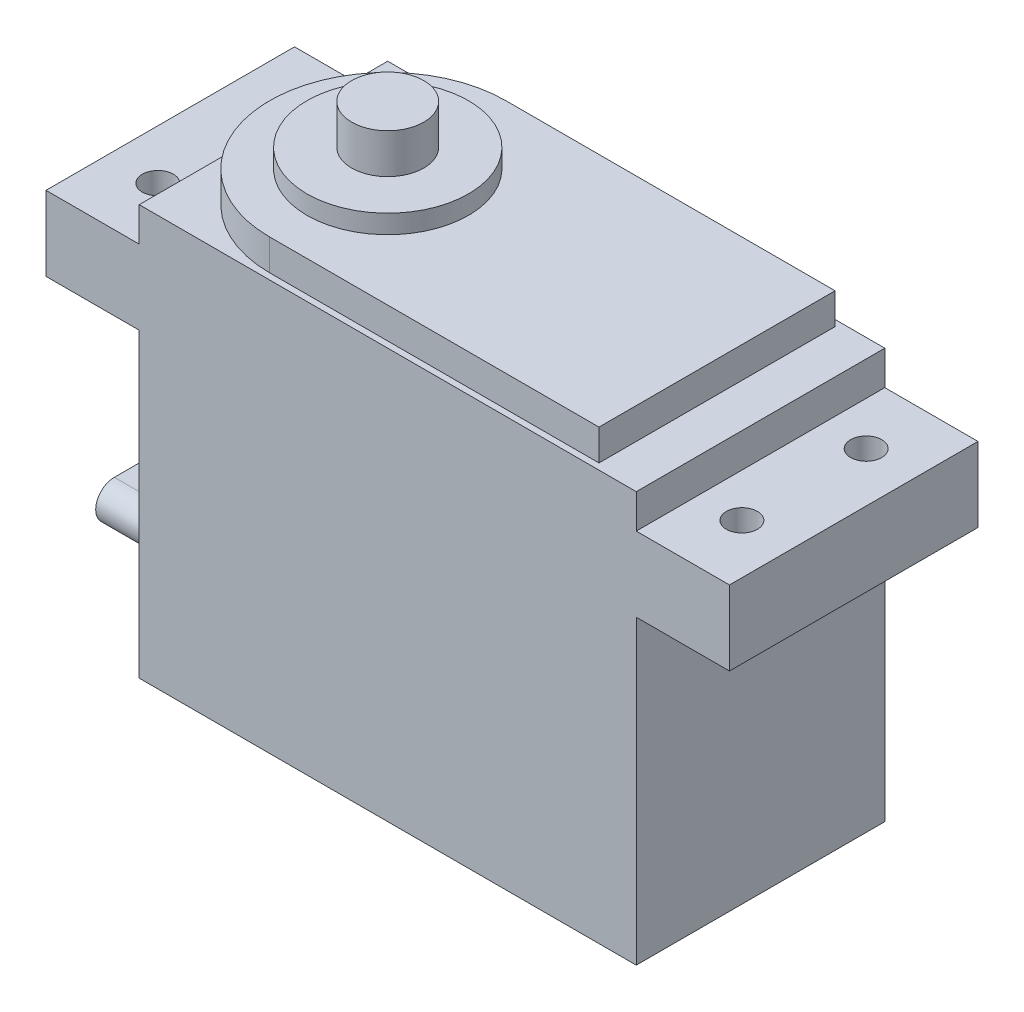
ISO-10303-21;
HEADER;
FILE_DESCRIPTION(('STEP AP214'),'2;1');
FILE_NAME('part.step','',(''),(''),'','','');
FILE_SCHEMA(('AUTOMOTIVE_DESIGN { 1 0 10303 214 1 1 1 1 }'));
ENDSEC;
DATA;
#1=APPLICATION_CONTEXT('core data for automotive mechanical design processes');
#2=APPLICATION_PROTOCOL_DEFINITION('international standard','automotive_design',2000,#1);
#3=PRODUCT_CONTEXT('',#1,'mechanical');
#4=PRODUCT('Part','Part','',(#3));
#5=PRODUCT_RELATED_PRODUCT_CATEGORY('part','',(#4));
#6=PRODUCT_DEFINITION_FORMATION('','',#4);
#7=PRODUCT_DEFINITION_CONTEXT('part definition',#1,'design');
#8=PRODUCT_DEFINITION('design','',#6,#7);
#9=PRODUCT_DEFINITION_SHAPE('','',#8);
#10=(LENGTH_UNIT() NAMED_UNIT(*) SI_UNIT(.MILLI.,.METRE.));
#11=(NAMED_UNIT(*) PLANE_ANGLE_UNIT() SI_UNIT($,.RADIAN.));
#12=(NAMED_UNIT(*) SI_UNIT($,.STERADIAN.) SOLID_ANGLE_UNIT());
#13=UNCERTAINTY_MEASURE_WITH_UNIT(LENGTH_MEASURE(1.E-05),#10,'distance_accuracy_value','');
#14=(GEOMETRIC_REPRESENTATION_CONTEXT(3) GLOBAL_UNCERTAINTY_ASSIGNED_CONTEXT((#13)) GLOBAL_UNIT_ASSIGNED_CONTEXT((#10,
#11,#12)) REPRESENTATION_CONTEXT('',''));
#15=CARTESIAN_POINT('',(0.,0.,0.));
#16=DIRECTION('',(0.,0.,1.));
#17=DIRECTION('',(1.,0.,0.));
#18=AXIS2_PLACEMENT_3D('',#15,#16,#17);
#19=CARTESIAN_POINT('',(-0.5,3.,9.5));
#20=DIRECTION('',(-1.,0.,0.));
#21=DIRECTION('',(0.,0.,1.));
#22=AXIS2_PLACEMENT_3D('',#19,#20,#21);
#23=PLANE('',#22);
#24=CARTESIAN_POINT('',(-0.5,3.,9.5));
#25=DIRECTION('',(-1.,0.,0.));
#26=DIRECTION('',(0.,0.,1.));
#27=AXIS2_PLACEMENT_3D('',#24,#25,#26);
#28=CIRCLE('',#27,2.);
#29=CARTESIAN_POINT('',(-0.5,5.,9.5));
#30=VERTEX_POINT('',#29);
#31=CARTESIAN_POINT('',(-0.5,1.,9.50000000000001));
#32=VERTEX_POINT('',#31);
#33=EDGE_CURVE('E230',#30,#32,#28,.T.);
#34=ORIENTED_EDGE('',*,*,#33,.T.);
#35=DIRECTION('',(0.,0.,1.));
#36=VECTOR('',#35,1.);
#37=CARTESIAN_POINT('',(-0.5,1.,11.5));
#38=LINE('',#37,#36);
#39=CARTESIAN_POINT('',(-0.5,1.,11.5));
#40=VERTEX_POINT('',#39);
#41=EDGE_CURVE('E233',#32,#40,#38,.T.);
#42=ORIENTED_EDGE('',*,*,#41,.T.);
#43=CARTESIAN_POINT('',(-0.5,3.,11.5));
#44=DIRECTION('',(-1.,0.,0.));
#45=DIRECTION('',(0.,0.,-1.));
#46=AXIS2_PLACEMENT_3D('',#43,#44,#45);
#47=CIRCLE('',#46,2.);
#48=CARTESIAN_POINT('',(-0.5,5.,11.5));
#49=VERTEX_POINT('',#48);
#50=EDGE_CURVE('E236',#40,#49,#47,.T.);
#51=ORIENTED_EDGE('',*,*,#50,.T.);
#52=DIRECTION('',(0.,0.,-1.));
#53=VECTOR('',#52,1.);
#54=CARTESIAN_POINT('',(-0.5,5.,9.5));
#55=LINE('',#54,#53);
#56=EDGE_CURVE('E238',#49,#30,#55,.T.);
#57=ORIENTED_EDGE('',*,*,#56,.T.);
#58=EDGE_LOOP('',(#34,#42,#51,#57));
#59=FACE_BOUND('',#58,.T.);
#60=DIRECTION('',(0.,0.,1.));
#61=VECTOR('',#60,1.);
#62=CARTESIAN_POINT('',(-0.5,1.5,9.50000000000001));
#63=LINE('',#62,#61);
#64=CARTESIAN_POINT('',(-0.5,1.5,9.50000000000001));
#65=VERTEX_POINT('',#64);
#66=CARTESIAN_POINT('',(-0.5,1.5,11.5));
#67=VERTEX_POINT('',#66);
#68=EDGE_CURVE('E799',#65,#67,#63,.T.);
#69=ORIENTED_EDGE('',*,*,#68,.F.);
#70=CARTESIAN_POINT('',(-0.5,3.,9.5));
#71=DIRECTION('',(-1.,0.,0.));
#72=DIRECTION('',(0.,0.,1.));
#73=AXIS2_PLACEMENT_3D('',#70,#71,#72);
#74=CIRCLE('',#73,1.5);
#75=CARTESIAN_POINT('',(-0.5,4.5,9.5));
#76=VERTEX_POINT('',#75);
#77=EDGE_CURVE('E221',#76,#65,#74,.T.);
#78=ORIENTED_EDGE('',*,*,#77,.F.);
#79=DIRECTION('',(0.,0.,-1.));
#80=VECTOR('',#79,1.);
#81=CARTESIAN_POINT('',(-0.5,4.5,11.5));
#82=LINE('',#81,#80);
#83=CARTESIAN_POINT('',(-0.5,4.5,11.5));
#84=VERTEX_POINT('',#83);
#85=EDGE_CURVE('E217',#84,#76,#82,.T.);
#86=ORIENTED_EDGE('',*,*,#85,.F.);
#87=CARTESIAN_POINT('',(-0.5,3.,11.5));
#88=DIRECTION('',(-1.,0.,0.));
#89=DIRECTION('',(0.,0.,1.));
#90=AXIS2_PLACEMENT_3D('',#87,#88,#89);
#91=CIRCLE('',#90,1.5);
#92=EDGE_CURVE('E796',#67,#84,#91,.T.);
#93=ORIENTED_EDGE('',*,*,#92,.F.);
#94=EDGE_LOOP('',(#69,#78,#86,#93));
#95=FACE_BOUND('',#94,.T.);
#96=ADVANCED_FACE('F35',(#59,#95),#23,.T.);
#97=CARTESIAN_POINT('',(0.,0.,20.));
#98=DIRECTION('',(1.,0.,0.));
#99=DIRECTION('',(0.,0.,-1.));
#100=AXIS2_PLACEMENT_3D('',#97,#98,#99);
#101=PLANE('',#100);
#102=DIRECTION('',(0.,-1.,0.));
#103=VECTOR('',#102,1.);
#104=CARTESIAN_POINT('',(0.,0.,0.));
#105=LINE('',#104,#103);
#106=CARTESIAN_POINT('',(0.,24.25,0.));
#107=VERTEX_POINT('',#106);
#108=CARTESIAN_POINT('',(0.,0.,0.));
#109=VERTEX_POINT('',#108);
#110=EDGE_CURVE('E348',#107,#109,#105,.T.);
#111=ORIENTED_EDGE('',*,*,#110,.T.);
#112=DIRECTION('',(0.,0.,-1.));
#113=VECTOR('',#112,1.);
#114=CARTESIAN_POINT('',(0.,0.,20.));
#115=LINE('',#114,#113);
#116=CARTESIAN_POINT('',(0.,0.,20.));
#117=VERTEX_POINT('',#116);
#118=EDGE_CURVE('E11',#117,#109,#115,.T.);
#119=ORIENTED_EDGE('',*,*,#118,.F.);
#120=DIRECTION('',(0.,-1.,0.));
#121=VECTOR('',#120,1.);
#122=CARTESIAN_POINT('',(0.,0.,20.));
#123=LINE('',#122,#121);
#124=CARTESIAN_POINT('',(0.,24.25,20.));
#125=VERTEX_POINT('',#124);
#126=EDGE_CURVE('E321',#125,#117,#123,.T.);
#127=ORIENTED_EDGE('',*,*,#126,.F.);
#128=DIRECTION('',(0.,0.,-1.));
#129=VECTOR('',#128,1.);
#130=CARTESIAN_POINT('',(0.,24.25,20.));
#131=LINE('',#130,#129);
#132=EDGE_CURVE('E347',#125,#107,#131,.T.);
#133=ORIENTED_EDGE('',*,*,#132,.T.);
#134=EDGE_LOOP('',(#111,#119,#127,#133));
#135=FACE_BOUND('',#134,.T.);
#136=CARTESIAN_POINT('',(0.,3.,9.5));
#137=DIRECTION('',(-1.,0.,0.));
#138=DIRECTION('',(0.,0.,1.));
#139=AXIS2_PLACEMENT_3D('',#136,#137,#138);
#140=CIRCLE('',#139,2.);
#141=CARTESIAN_POINT('',(0.,5.,9.5));
#142=VERTEX_POINT('',#141);
#143=CARTESIAN_POINT('',(0.,1.,9.50000000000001));
#144=VERTEX_POINT('',#143);
#145=EDGE_CURVE('E223',#142,#144,#140,.T.);
#146=ORIENTED_EDGE('',*,*,#145,.F.);
#147=DIRECTION('',(0.,0.,-1.));
#148=VECTOR('',#147,1.);
#149=CARTESIAN_POINT('',(0.,5.,9.5));
#150=LINE('',#149,#148);
#151=CARTESIAN_POINT('',(0.,5.,11.5));
#152=VERTEX_POINT('',#151);
#153=EDGE_CURVE('E234',#152,#142,#150,.T.);
#154=ORIENTED_EDGE('',*,*,#153,.F.);
#155=CARTESIAN_POINT('',(0.,3.,11.5));
#156=DIRECTION('',(-1.,0.,0.));
#157=DIRECTION('',(0.,0.,-1.));
#158=AXIS2_PLACEMENT_3D('',#155,#156,#157);
#159=CIRCLE('',#158,2.);
#160=CARTESIAN_POINT('',(0.,1.,11.5));
#161=VERTEX_POINT('',#160);
#162=EDGE_CURVE('E242',#161,#152,#159,.T.);
#163=ORIENTED_EDGE('',*,*,#162,.F.);
#164=DIRECTION('',(0.,0.,1.));
#165=VECTOR('',#164,1.);
#166=CARTESIAN_POINT('',(0.,1.,11.5));
#167=LINE('',#166,#165);
#168=EDGE_CURVE('E60',#144,#161,#167,.T.);
#169=ORIENTED_EDGE('',*,*,#168,.F.);
#170=EDGE_LOOP('',(#146,#154,#163,#169));
#171=FACE_BOUND('',#170,.T.);
#172=ADVANCED_FACE('F37',(#135,#171),#101,.F.);
#173=CARTESIAN_POINT('',(10.,37.,10.));
#174=DIRECTION('',(0.,1.,0.));
#175=DIRECTION('',(0.,0.,1.));
#176=AXIS2_PLACEMENT_3D('',#173,#174,#175);
#177=PLANE('',#176);
#178=CARTESIAN_POINT('',(10.,37.,10.));
#179=DIRECTION('',(0.,1.,0.));
#180=DIRECTION('',(0.,0.,1.));
#181=AXIS2_PLACEMENT_3D('',#178,#179,#180);
#182=CIRCLE('',#181,6.5);
#183=CARTESIAN_POINT('',(10.,37.,16.5));
#184=VERTEX_POINT('',#183);
#185=EDGE_CURVE('E264',#184,#184,#182,.T.);
#186=ORIENTED_EDGE('',*,*,#185,.T.);
#187=EDGE_LOOP('',(#186));
#188=FACE_BOUND('',#187,.T.);
#189=CARTESIAN_POINT('',(10.,37.,10.));
#190=DIRECTION('',(0.,1.,0.));
#191=DIRECTION('',(0.,0.,1.));
#192=AXIS2_PLACEMENT_3D('',#189,#190,#191);
#193=CIRCLE('',#192,2.9);
#194=CARTESIAN_POINT('',(10.,37.,12.9));
#195=VERTEX_POINT('',#194);
#196=EDGE_CURVE('E257',#195,#195,#193,.T.);
#197=ORIENTED_EDGE('',*,*,#196,.F.);
#198=EDGE_LOOP('',(#197));
#199=FACE_BOUND('',#198,.T.);
#200=ADVANCED_FACE('F431',(#188,#199),#177,.T.);
#201=CARTESIAN_POINT('',(10.,35.5,10.));
#202=DIRECTION('',(0.,1.,0.));
#203=DIRECTION('',(0.,0.,1.));
#204=AXIS2_PLACEMENT_3D('',#201,#202,#203);
#205=PLANE('',#204);
#206=DIRECTION('',(0.,0.,-1.));
#207=VECTOR('',#206,1.);
#208=CARTESIAN_POINT('',(36.5,35.5,0.5));
#209=LINE('',#208,#207);
#210=CARTESIAN_POINT('',(36.5,35.5,19.5));
#211=VERTEX_POINT('',#210);
#212=CARTESIAN_POINT('',(36.5,35.5,0.5));
#213=VERTEX_POINT('',#212);
#214=EDGE_CURVE('E270',#211,#213,#209,.T.);
#215=ORIENTED_EDGE('',*,*,#214,.T.);
#216=DIRECTION('',(-1.,0.,0.));
#217=VECTOR('',#216,1.);
#218=CARTESIAN_POINT('',(10.,35.5,0.5));
#219=LINE('',#218,#217);
#220=CARTESIAN_POINT('',(10.,35.5,0.5));
#221=VERTEX_POINT('',#220);
#222=EDGE_CURVE('E273',#213,#221,#219,.T.);
#223=ORIENTED_EDGE('',*,*,#222,.T.);
#224=CARTESIAN_POINT('',(10.,35.5,10.));
#225=DIRECTION('',(0.,1.,0.));
#226=DIRECTION('',(0.,0.,1.));
#227=AXIS2_PLACEMENT_3D('',#224,#225,#226);
#228=CIRCLE('',#227,9.5);
#229=CARTESIAN_POINT('',(10.,35.5,19.5));
#230=VERTEX_POINT('',#229);
#231=EDGE_CURVE('E276',#221,#230,#228,.T.);
#232=ORIENTED_EDGE('',*,*,#231,.T.);
#233=DIRECTION('',(1.,0.,0.));
#234=VECTOR('',#233,1.);
#235=CARTESIAN_POINT('',(36.5,35.5,19.5));
#236=LINE('',#235,#234);
#237=EDGE_CURVE('E278',#230,#211,#236,.T.);
#238=ORIENTED_EDGE('',*,*,#237,.T.);
#239=EDGE_LOOP('',(#215,#223,#232,#238));
#240=FACE_BOUND('',#239,.T.);
#241=CARTESIAN_POINT('',(10.,35.5,10.));
#242=DIRECTION('',(0.,1.,0.));
#243=DIRECTION('',(0.,0.,1.));
#244=AXIS2_PLACEMENT_3D('',#241,#242,#243);
#245=CIRCLE('',#244,6.5);
#246=CARTESIAN_POINT('',(10.,35.5,16.5));
#247=VERTEX_POINT('',#246);
#248=EDGE_CURVE('E261',#247,#247,#245,.T.);
#249=ORIENTED_EDGE('',*,*,#248,.F.);
#250=EDGE_LOOP('',(#249));
#251=FACE_BOUND('',#250,.T.);
#252=ADVANCED_FACE('F464',(#240,#251),#205,.T.);
#253=CARTESIAN_POINT('',(0.,33.,20.));
#254=DIRECTION('',(0.,-1.,0.));
#255=DIRECTION('',(0.,0.,-1.));
#256=AXIS2_PLACEMENT_3D('',#253,#254,#255);
#257=PLANE('',#256);
#258=DIRECTION('',(-1.,0.,0.));
#259=VECTOR('',#258,1.);
#260=CARTESIAN_POINT('',(0.,33.,0.));
#261=LINE('',#260,#259);
#262=CARTESIAN_POINT('',(40.,33.,0.));
#263=VERTEX_POINT('',#262);
#264=CARTESIAN_POINT('',(0.,33.,0.));
#265=VERTEX_POINT('',#264);
#266=EDGE_CURVE('E363',#263,#265,#261,.T.);
#267=ORIENTED_EDGE('',*,*,#266,.T.);
#268=DIRECTION('',(0.,0.,-1.));
#269=VECTOR('',#268,1.);
#270=CARTESIAN_POINT('',(0.,33.,20.));
#271=LINE('',#270,#269);
#272=CARTESIAN_POINT('',(0.,33.,20.));
#273=VERTEX_POINT('',#272);
#274=EDGE_CURVE('E383',#273,#265,#271,.T.);
#275=ORIENTED_EDGE('',*,*,#274,.F.);
#276=DIRECTION('',(-1.,0.,0.));
#277=VECTOR('',#276,1.);
#278=CARTESIAN_POINT('',(0.,33.,20.));
#279=LINE('',#278,#277);
#280=CARTESIAN_POINT('',(40.,33.,20.));
#281=VERTEX_POINT('',#280);
#282=EDGE_CURVE('E337',#281,#273,#279,.T.);
#283=ORIENTED_EDGE('',*,*,#282,.F.);
#284=DIRECTION('',(0.,0.,-1.));
#285=VECTOR('',#284,1.);
#286=CARTESIAN_POINT('',(40.,33.,20.));
#287=LINE('',#286,#285);
#288=EDGE_CURVE('E386',#281,#263,#287,.T.);
#289=ORIENTED_EDGE('',*,*,#288,.T.);
#290=EDGE_LOOP('',(#267,#275,#283,#289));
#291=FACE_BOUND('',#290,.T.);
#292=DIRECTION('',(0.,0.,-1.));
#293=VECTOR('',#292,1.);
#294=CARTESIAN_POINT('',(36.5,33.,0.5));
#295=LINE('',#294,#293);
#296=CARTESIAN_POINT('',(36.5,33.,19.5));
#297=VERTEX_POINT('',#296);
#298=CARTESIAN_POINT('',(36.5,33.,0.5));
#299=VERTEX_POINT('',#298);
#300=EDGE_CURVE('E267',#297,#299,#295,.T.);
#301=ORIENTED_EDGE('',*,*,#300,.F.);
#302=DIRECTION('',(1.,0.,0.));
#303=VECTOR('',#302,1.);
#304=CARTESIAN_POINT('',(36.5,33.,19.5));
#305=LINE('',#304,#303);
#306=CARTESIAN_POINT('',(10.,33.,19.5));
#307=VERTEX_POINT('',#306);
#308=EDGE_CURVE('E274',#307,#297,#305,.T.);
#309=ORIENTED_EDGE('',*,*,#308,.F.);
#310=CARTESIAN_POINT('',(10.,33.,10.));
#311=DIRECTION('',(0.,1.,0.));
#312=DIRECTION('',(0.,0.,1.));
#313=AXIS2_PLACEMENT_3D('',#310,#311,#312);
#314=CIRCLE('',#313,9.5);
#315=CARTESIAN_POINT('',(10.,33.,0.5));
#316=VERTEX_POINT('',#315);
#317=EDGE_CURVE('E286',#316,#307,#314,.T.);
#318=ORIENTED_EDGE('',*,*,#317,.F.);
#319=DIRECTION('',(-1.,0.,0.));
#320=VECTOR('',#319,1.);
#321=CARTESIAN_POINT('',(10.,33.,0.5));
#322=LINE('',#321,#320);
#323=EDGE_CURVE('E283',#299,#316,#322,.T.);
#324=ORIENTED_EDGE('',*,*,#323,.F.);
#325=EDGE_LOOP('',(#301,#309,#318,#324));
#326=FACE_BOUND('',#325,.T.);
#327=ADVANCED_FACE('F472',(#291,#326),#257,.F.);
#328=CARTESIAN_POINT('',(0.,0.,20.));
#329=DIRECTION('',(0.,1.,0.));
#330=DIRECTION('',(0.,0.,1.));
#331=AXIS2_PLACEMENT_3D('',#328,#329,#330);
#332=PLANE('',#331);
#333=DIRECTION('',(1.,0.,0.));
#334=VECTOR('',#333,1.);
#335=CARTESIAN_POINT('',(0.,0.,0.));
#336=LINE('',#335,#334);
#337=CARTESIAN_POINT('',(40.,0.,0.));
#338=VERTEX_POINT('',#337);
#339=EDGE_CURVE('E351',#109,#338,#336,.T.);
#340=ORIENTED_EDGE('',*,*,#339,.T.);
#341=DIRECTION('',(0.,0.,-1.));
#342=VECTOR('',#341,1.);
#343=CARTESIAN_POINT('',(40.,0.,20.));
#344=LINE('',#343,#342);
#345=CARTESIAN_POINT('',(40.,0.,20.));
#346=VERTEX_POINT('',#345);
#347=EDGE_CURVE('E44',#346,#338,#344,.T.);
#348=ORIENTED_EDGE('',*,*,#347,.F.);
#349=DIRECTION('',(1.,0.,0.));
#350=VECTOR('',#349,1.);
#351=CARTESIAN_POINT('',(0.,0.,20.));
#352=LINE('',#351,#350);
#353=EDGE_CURVE('E324',#117,#346,#352,.T.);
#354=ORIENTED_EDGE('',*,*,#353,.F.);
#355=ORIENTED_EDGE('',*,*,#118,.T.);
#356=EDGE_LOOP('',(#340,#348,#354,#355));
#357=FACE_BOUND('',#356,.T.);
#358=ADVANCED_FACE('F538',(#357),#332,.F.);
#359=CARTESIAN_POINT('',(40.,0.,20.));
#360=DIRECTION('',(-1.,0.,0.));
#361=DIRECTION('',(0.,0.,1.));
#362=AXIS2_PLACEMENT_3D('',#359,#360,#361);
#363=PLANE('',#362);
#364=DIRECTION('',(0.,1.,0.));
#365=VECTOR('',#364,1.);
#366=CARTESIAN_POINT('',(40.,0.,0.));
#367=LINE('',#366,#365);
#368=CARTESIAN_POINT('',(40.,24.25,0.));
#369=VERTEX_POINT('',#368);
#370=EDGE_CURVE('E353',#338,#369,#367,.T.);
#371=ORIENTED_EDGE('',*,*,#370,.T.);
#372=DIRECTION('',(0.,0.,-1.));
#373=VECTOR('',#372,1.);
#374=CARTESIAN_POINT('',(40.,24.25,20.));
#375=LINE('',#374,#373);
#376=CARTESIAN_POINT('',(40.,24.25,20.));
#377=VERTEX_POINT('',#376);
#378=EDGE_CURVE('E398',#377,#369,#375,.T.);
#379=ORIENTED_EDGE('',*,*,#378,.F.);
#380=DIRECTION('',(0.,1.,0.));
#381=VECTOR('',#380,1.);
#382=CARTESIAN_POINT('',(40.,0.,20.));
#383=LINE('',#382,#381);
#384=EDGE_CURVE('E327',#346,#377,#383,.T.);
#385=ORIENTED_EDGE('',*,*,#384,.F.);
#386=ORIENTED_EDGE('',*,*,#347,.T.);
#387=EDGE_LOOP('',(#371,#379,#385,#386));
#388=FACE_BOUND('',#387,.T.);
#389=ADVANCED_FACE('F505',(#388),#363,.F.);
#390=CARTESIAN_POINT('',(40.,24.25,20.));
#391=DIRECTION('',(0.,1.,0.));
#392=DIRECTION('',(0.,0.,1.));
#393=AXIS2_PLACEMENT_3D('',#390,#391,#392);
#394=PLANE('',#393);
#395=CARTESIAN_POINT('',(43.5,24.25,5.));
#396=DIRECTION('',(0.,1.,0.));
#397=DIRECTION('',(0.,0.,1.));
#398=AXIS2_PLACEMENT_3D('',#395,#396,#397);
#399=CIRCLE('',#398,1.25);
#400=CARTESIAN_POINT('',(43.5,24.25,6.25));
#401=VERTEX_POINT('',#400);
#402=EDGE_CURVE('E305',#401,#401,#399,.T.);
#403=ORIENTED_EDGE('',*,*,#402,.T.);
#404=EDGE_LOOP('',(#403));
#405=FACE_BOUND('',#404,.T.);
#406=CARTESIAN_POINT('',(43.5,24.25,15.));
#407=DIRECTION('',(0.,1.,0.));
#408=DIRECTION('',(0.,0.,1.));
#409=AXIS2_PLACEMENT_3D('',#406,#407,#408);
#410=CIRCLE('',#409,1.25);
#411=CARTESIAN_POINT('',(43.5,24.25,16.25));
#412=VERTEX_POINT('',#411);
#413=EDGE_CURVE('E311',#412,#412,#410,.T.);
#414=ORIENTED_EDGE('',*,*,#413,.T.);
#415=EDGE_LOOP('',(#414));
#416=FACE_BOUND('',#415,.T.);
#417=DIRECTION('',(1.,0.,0.));
#418=VECTOR('',#417,1.);
#419=CARTESIAN_POINT('',(40.,24.25,0.));
#420=LINE('',#419,#418);
#421=CARTESIAN_POINT('',(47.5,24.25,0.));
#422=VERTEX_POINT('',#421);
#423=EDGE_CURVE('E355',#369,#422,#420,.T.);
#424=ORIENTED_EDGE('',*,*,#423,.T.);
#425=DIRECTION('',(0.,0.,-1.));
#426=VECTOR('',#425,1.);
#427=CARTESIAN_POINT('',(47.5,24.25,20.));
#428=LINE('',#427,#426);
#429=CARTESIAN_POINT('',(47.5,24.25,20.));
#430=VERTEX_POINT('',#429);
#431=EDGE_CURVE('E395',#430,#422,#428,.T.);
#432=ORIENTED_EDGE('',*,*,#431,.F.);
#433=DIRECTION('',(1.,0.,0.));
#434=VECTOR('',#433,1.);
#435=CARTESIAN_POINT('',(40.,24.25,20.));
#436=LINE('',#435,#434);
#437=EDGE_CURVE('E329',#377,#430,#436,.T.);
#438=ORIENTED_EDGE('',*,*,#437,.F.);
#439=ORIENTED_EDGE('',*,*,#378,.T.);
#440=EDGE_LOOP('',(#424,#432,#438,#439));
#441=FACE_BOUND('',#440,.T.);
#442=ADVANCED_FACE('F501',(#405,#416,#441),#394,.F.);
#443=CARTESIAN_POINT('',(47.5,24.25,20.));
#444=DIRECTION('',(-1.,0.,0.));
#445=DIRECTION('',(0.,0.,1.));
#446=AXIS2_PLACEMENT_3D('',#443,#444,#445);
#447=PLANE('',#446);
#448=DIRECTION('',(0.,1.,0.));
#449=VECTOR('',#448,1.);
#450=CARTESIAN_POINT('',(47.5,24.25,0.));
#451=LINE('',#450,#449);
#452=CARTESIAN_POINT('',(47.5,30.25,0.));
#453=VERTEX_POINT('',#452);
#454=EDGE_CURVE('E357',#422,#453,#451,.T.);
#455=ORIENTED_EDGE('',*,*,#454,.T.);
#456=DIRECTION('',(0.,0.,-1.));
#457=VECTOR('',#456,1.);
#458=CARTESIAN_POINT('',(47.5,30.25,20.));
#459=LINE('',#458,#457);
#460=CARTESIAN_POINT('',(47.5,30.25,20.));
#461=VERTEX_POINT('',#460);
#462=EDGE_CURVE('E392',#461,#453,#459,.T.);
#463=ORIENTED_EDGE('',*,*,#462,.F.);
#464=DIRECTION('',(0.,1.,0.));
#465=VECTOR('',#464,1.);
#466=CARTESIAN_POINT('',(47.5,24.25,20.));
#467=LINE('',#466,#465);
#468=EDGE_CURVE('E331',#430,#461,#467,.T.);
#469=ORIENTED_EDGE('',*,*,#468,.F.);
#470=ORIENTED_EDGE('',*,*,#431,.T.);
#471=EDGE_LOOP('',(#455,#463,#469,#470));
#472=FACE_BOUND('',#471,.T.);
#473=ADVANCED_FACE('F504',(#472),#447,.F.);
#474=CARTESIAN_POINT('',(47.5,30.25,20.));
#475=DIRECTION('',(0.,-1.,0.));
#476=DIRECTION('',(0.,0.,-1.));
#477=AXIS2_PLACEMENT_3D('',#474,#475,#476);
#478=PLANE('',#477);
#479=CARTESIAN_POINT('',(43.5,30.25,5.));
#480=DIRECTION('',(0.,1.,0.));
#481=DIRECTION('',(0.,0.,1.));
#482=AXIS2_PLACEMENT_3D('',#479,#480,#481);
#483=CIRCLE('',#482,1.25);
#484=CARTESIAN_POINT('',(43.5,30.25,6.25));
#485=VERTEX_POINT('',#484);
#486=EDGE_CURVE('E302',#485,#485,#483,.T.);
#487=ORIENTED_EDGE('',*,*,#486,.F.);
#488=EDGE_LOOP('',(#487));
#489=FACE_BOUND('',#488,.T.);
#490=CARTESIAN_POINT('',(43.5,30.25,15.));
#491=DIRECTION('',(0.,1.,0.));
#492=DIRECTION('',(0.,0.,1.));
#493=AXIS2_PLACEMENT_3D('',#490,#491,#492);
#494=CIRCLE('',#493,1.25);
#495=CARTESIAN_POINT('',(43.5,30.25,16.25));
#496=VERTEX_POINT('',#495);
#497=EDGE_CURVE('E308',#496,#496,#494,.T.);
#498=ORIENTED_EDGE('',*,*,#497,.F.);
#499=EDGE_LOOP('',(#498));
#500=FACE_BOUND('',#499,.T.);
#501=DIRECTION('',(-1.,0.,0.));
#502=VECTOR('',#501,1.);
#503=CARTESIAN_POINT('',(47.5,30.25,0.));
#504=LINE('',#503,#502);
#505=CARTESIAN_POINT('',(40.,30.25,0.));
#506=VERTEX_POINT('',#505);
#507=EDGE_CURVE('E359',#453,#506,#504,.T.);
#508=ORIENTED_EDGE('',*,*,#507,.T.);
#509=DIRECTION('',(0.,0.,-1.));
#510=VECTOR('',#509,1.);
#511=CARTESIAN_POINT('',(40.,30.25,20.));
#512=LINE('',#511,#510);
#513=CARTESIAN_POINT('',(40.,30.25,20.));
#514=VERTEX_POINT('',#513);
#515=EDGE_CURVE('E389',#514,#506,#512,.T.);
#516=ORIENTED_EDGE('',*,*,#515,.F.);
#517=DIRECTION('',(-1.,0.,0.));
#518=VECTOR('',#517,1.);
#519=CARTESIAN_POINT('',(47.5,30.25,20.));
#520=LINE('',#519,#518);
#521=EDGE_CURVE('E333',#461,#514,#520,.T.);
#522=ORIENTED_EDGE('',*,*,#521,.F.);
#523=ORIENTED_EDGE('',*,*,#462,.T.);
#524=EDGE_LOOP('',(#508,#516,#522,#523));
#525=FACE_BOUND('',#524,.T.);
#526=ADVANCED_FACE('F523',(#489,#500,#525),#478,.F.);
#527=CARTESIAN_POINT('',(40.,30.25,20.));
#528=DIRECTION('',(-1.,0.,0.));
#529=DIRECTION('',(0.,0.,1.));
#530=AXIS2_PLACEMENT_3D('',#527,#528,#529);
#531=PLANE('',#530);
#532=DIRECTION('',(0.,1.,0.));
#533=VECTOR('',#532,1.);
#534=CARTESIAN_POINT('',(40.,30.25,0.));
#535=LINE('',#534,#533);
#536=EDGE_CURVE('E361',#506,#263,#535,.T.);
#537=ORIENTED_EDGE('',*,*,#536,.T.);
#538=ORIENTED_EDGE('',*,*,#288,.F.);
#539=DIRECTION('',(0.,1.,0.));
#540=VECTOR('',#539,1.);
#541=CARTESIAN_POINT('',(40.,30.25,20.));
#542=LINE('',#541,#540);
#543=EDGE_CURVE('E335',#514,#281,#542,.T.);
#544=ORIENTED_EDGE('',*,*,#543,.F.);
#545=ORIENTED_EDGE('',*,*,#515,.T.);
#546=EDGE_LOOP('',(#537,#538,#544,#545));
#547=FACE_BOUND('',#546,.T.);
#548=ADVANCED_FACE('F527',(#547),#531,.F.);
#549=CARTESIAN_POINT('',(0.,30.25,20.));
#550=DIRECTION('',(1.,0.,0.));
#551=DIRECTION('',(0.,0.,-1.));
#552=AXIS2_PLACEMENT_3D('',#549,#550,#551);
#553=PLANE('',#552);
#554=DIRECTION('',(0.,-1.,0.));
#555=VECTOR('',#554,1.);
#556=CARTESIAN_POINT('',(0.,30.25,0.));
#557=LINE('',#556,#555);
#558=CARTESIAN_POINT('',(0.,30.25,0.));
#559=VERTEX_POINT('',#558);
#560=EDGE_CURVE('E365',#265,#559,#557,.T.);
#561=ORIENTED_EDGE('',*,*,#560,.T.);
#562=DIRECTION('',(0.,0.,-1.));
#563=VECTOR('',#562,1.);
#564=CARTESIAN_POINT('',(0.,30.25,20.));
#565=LINE('',#564,#563);
#566=CARTESIAN_POINT('',(0.,30.25,20.));
#567=VERTEX_POINT('',#566);
#568=EDGE_CURVE('E380',#567,#559,#565,.T.);
#569=ORIENTED_EDGE('',*,*,#568,.F.);
#570=DIRECTION('',(0.,-1.,0.));
#571=VECTOR('',#570,1.);
#572=CARTESIAN_POINT('',(0.,30.25,20.));
#573=LINE('',#572,#571);
#574=EDGE_CURVE('E339',#273,#567,#573,.T.);
#575=ORIENTED_EDGE('',*,*,#574,.F.);
#576=ORIENTED_EDGE('',*,*,#274,.T.);
#577=EDGE_LOOP('',(#561,#569,#575,#576));
#578=FACE_BOUND('',#577,.T.);
#579=ADVANCED_FACE('F556',(#578),#553,.F.);
#580=CARTESIAN_POINT('',(0.,30.25,20.));
#581=DIRECTION('',(0.,-1.,0.));
#582=DIRECTION('',(0.,0.,-1.));
#583=AXIS2_PLACEMENT_3D('',#580,#581,#582);
#584=PLANE('',#583);
#585=CARTESIAN_POINT('',(-3.5,30.25,15.));
#586=DIRECTION('',(0.,1.,0.));
#587=DIRECTION('',(0.,0.,1.));
#588=AXIS2_PLACEMENT_3D('',#585,#586,#587);
#589=CIRCLE('',#588,1.25);
#590=CARTESIAN_POINT('',(-3.5,30.25,16.25));
#591=VERTEX_POINT('',#590);
#592=EDGE_CURVE('E314',#591,#591,#589,.T.);
#593=ORIENTED_EDGE('',*,*,#592,.F.);
#594=EDGE_LOOP('',(#593));
#595=FACE_BOUND('',#594,.T.);
#596=CARTESIAN_POINT('',(-3.5,30.25,5.));
#597=DIRECTION('',(0.,1.,0.));
#598=DIRECTION('',(0.,0.,1.));
#599=AXIS2_PLACEMENT_3D('',#596,#597,#598);
#600=CIRCLE('',#599,1.25);
#601=CARTESIAN_POINT('',(-3.5,30.25,6.25));
#602=VERTEX_POINT('',#601);
#603=EDGE_CURVE('E317',#602,#602,#600,.T.);
#604=ORIENTED_EDGE('',*,*,#603,.F.);
#605=EDGE_LOOP('',(#604));
#606=FACE_BOUND('',#605,.T.);
#607=DIRECTION('',(-1.,0.,0.));
#608=VECTOR('',#607,1.);
#609=CARTESIAN_POINT('',(0.,30.25,0.));
#610=LINE('',#609,#608);
#611=CARTESIAN_POINT('',(-7.5,30.25,0.));
#612=VERTEX_POINT('',#611);
#613=EDGE_CURVE('E367',#559,#612,#610,.T.);
#614=ORIENTED_EDGE('',*,*,#613,.T.);
#615=DIRECTION('',(0.,0.,-1.));
#616=VECTOR('',#615,1.);
#617=CARTESIAN_POINT('',(-7.5,30.25,20.));
#618=LINE('',#617,#616);
#619=CARTESIAN_POINT('',(-7.5,30.25,20.));
#620=VERTEX_POINT('',#619);
#621=EDGE_CURVE('E377',#620,#612,#618,.T.);
#622=ORIENTED_EDGE('',*,*,#621,.F.);
#623=DIRECTION('',(-1.,0.,0.));
#624=VECTOR('',#623,1.);
#625=CARTESIAN_POINT('',(0.,30.25,20.));
#626=LINE('',#625,#624);
#627=EDGE_CURVE('E341',#567,#620,#626,.T.);
#628=ORIENTED_EDGE('',*,*,#627,.F.);
#629=ORIENTED_EDGE('',*,*,#568,.T.);
#630=EDGE_LOOP('',(#614,#622,#628,#629));
#631=FACE_BOUND('',#630,.T.);
#632=ADVANCED_FACE('F552',(#595,#606,#631),#584,.F.);
#633=CARTESIAN_POINT('',(-7.5,24.25,20.));
#634=DIRECTION('',(1.,0.,0.));
#635=DIRECTION('',(0.,0.,-1.));
#636=AXIS2_PLACEMENT_3D('',#633,#634,#635);
#637=PLANE('',#636);
#638=DIRECTION('',(0.,-1.,0.));
#639=VECTOR('',#638,1.);
#640=CARTESIAN_POINT('',(-7.5,24.25,0.));
#641=LINE('',#640,#639);
#642=CARTESIAN_POINT('',(-7.5,24.25,0.));
#643=VERTEX_POINT('',#642);
#644=EDGE_CURVE('E369',#612,#643,#641,.T.);
#645=ORIENTED_EDGE('',*,*,#644,.T.);
#646=DIRECTION('',(0.,0.,-1.));
#647=VECTOR('',#646,1.);
#648=CARTESIAN_POINT('',(-7.5,24.25,20.));
#649=LINE('',#648,#647);
#650=CARTESIAN_POINT('',(-7.5,24.25,20.));
#651=VERTEX_POINT('',#650);
#652=EDGE_CURVE('E374',#651,#643,#649,.T.);
#653=ORIENTED_EDGE('',*,*,#652,.F.);
#654=DIRECTION('',(0.,-1.,0.));
#655=VECTOR('',#654,1.);
#656=CARTESIAN_POINT('',(-7.5,24.25,20.));
#657=LINE('',#656,#655);
#658=EDGE_CURVE('E343',#620,#651,#657,.T.);
#659=ORIENTED_EDGE('',*,*,#658,.F.);
#660=ORIENTED_EDGE('',*,*,#621,.T.);
#661=EDGE_LOOP('',(#645,#653,#659,#660));
#662=FACE_BOUND('',#661,.T.);
#663=ADVANCED_FACE('F547',(#662),#637,.F.);
#664=CARTESIAN_POINT('',(-7.5,24.25,20.));
#665=DIRECTION('',(0.,1.,0.));
#666=DIRECTION('',(0.,0.,1.));
#667=AXIS2_PLACEMENT_3D('',#664,#665,#666);
#668=PLANE('',#667);
#669=CARTESIAN_POINT('',(-3.5,24.25,15.));
#670=DIRECTION('',(0.,1.,0.));
#671=DIRECTION('',(0.,0.,1.));
#672=AXIS2_PLACEMENT_3D('',#669,#670,#671);
#673=CIRCLE('',#672,1.25);
#674=CARTESIAN_POINT('',(-3.5,24.25,16.25));
#675=VERTEX_POINT('',#674);
#676=EDGE_CURVE('E39',#675,#675,#673,.T.);
#677=ORIENTED_EDGE('',*,*,#676,.T.);
#678=EDGE_LOOP('',(#677));
#679=FACE_BOUND('',#678,.T.);
#680=CARTESIAN_POINT('',(-3.5,24.25,5.));
#681=DIRECTION('',(0.,1.,0.));
#682=DIRECTION('',(0.,0.,1.));
#683=AXIS2_PLACEMENT_3D('',#680,#681,#682);
#684=CIRCLE('',#683,1.25);
#685=CARTESIAN_POINT('',(-3.5,24.25,6.25));
#686=VERTEX_POINT('',#685);
#687=EDGE_CURVE('E320',#686,#686,#684,.T.);
#688=ORIENTED_EDGE('',*,*,#687,.T.);
#689=EDGE_LOOP('',(#688));
#690=FACE_BOUND('',#689,.T.);
#691=DIRECTION('',(1.,0.,0.));
#692=VECTOR('',#691,1.);
#693=CARTESIAN_POINT('',(-7.5,24.25,0.));
#694=LINE('',#693,#692);
#695=EDGE_CURVE('E325',#643,#107,#694,.T.);
#696=ORIENTED_EDGE('',*,*,#695,.T.);
#697=ORIENTED_EDGE('',*,*,#132,.F.);
#698=DIRECTION('',(1.,0.,0.));
#699=VECTOR('',#698,1.);
#700=CARTESIAN_POINT('',(-7.5,24.25,20.));
#701=LINE('',#700,#699);
#702=EDGE_CURVE('E345',#651,#125,#701,.T.);
#703=ORIENTED_EDGE('',*,*,#702,.F.);
#704=ORIENTED_EDGE('',*,*,#652,.T.);
#705=EDGE_LOOP('',(#696,#697,#703,#704));
#706=FACE_BOUND('',#705,.T.);
#707=ADVANCED_FACE('F405',(#679,#690,#706),#668,.F.);
#708=CARTESIAN_POINT('',(0.,24.25,20.));
#709=DIRECTION('',(0.,0.,-1.));
#710=DIRECTION('',(-1.,0.,0.));
#711=AXIS2_PLACEMENT_3D('',#708,#709,#710);
#712=PLANE('',#711);
#713=ORIENTED_EDGE('',*,*,#126,.T.);
#714=ORIENTED_EDGE('',*,*,#353,.T.);
#715=ORIENTED_EDGE('',*,*,#384,.T.);
#716=ORIENTED_EDGE('',*,*,#437,.T.);
#717=ORIENTED_EDGE('',*,*,#468,.T.);
#718=ORIENTED_EDGE('',*,*,#521,.T.);
#719=ORIENTED_EDGE('',*,*,#543,.T.);
#720=ORIENTED_EDGE('',*,*,#282,.T.);
#721=ORIENTED_EDGE('',*,*,#574,.T.);
#722=ORIENTED_EDGE('',*,*,#627,.T.);
#723=ORIENTED_EDGE('',*,*,#658,.T.);
#724=ORIENTED_EDGE('',*,*,#702,.T.);
#725=EDGE_LOOP('',(#713,#714,#715,#716,#717,#718,#719,#720,#721,#722,#723,#724));
#726=FACE_BOUND('',#725,.T.);
#727=ADVANCED_FACE('F421',(#726),#712,.F.);
#728=CARTESIAN_POINT('',(0.,24.25,0.));
#729=DIRECTION('',(0.,0.,-1.));
#730=DIRECTION('',(-1.,0.,0.));
#731=AXIS2_PLACEMENT_3D('',#728,#729,#730);
#732=PLANE('',#731);
#733=ORIENTED_EDGE('',*,*,#110,.F.);
#734=ORIENTED_EDGE('',*,*,#695,.F.);
#735=ORIENTED_EDGE('',*,*,#644,.F.);
#736=ORIENTED_EDGE('',*,*,#613,.F.);
#737=ORIENTED_EDGE('',*,*,#560,.F.);
#738=ORIENTED_EDGE('',*,*,#266,.F.);
#739=ORIENTED_EDGE('',*,*,#536,.F.);
#740=ORIENTED_EDGE('',*,*,#507,.F.);
#741=ORIENTED_EDGE('',*,*,#454,.F.);
#742=ORIENTED_EDGE('',*,*,#423,.F.);
#743=ORIENTED_EDGE('',*,*,#370,.F.);
#744=ORIENTED_EDGE('',*,*,#339,.F.);
#745=EDGE_LOOP('',(#733,#734,#735,#736,#737,#738,#739,#740,#741,#742,#743,#744));
#746=FACE_BOUND('',#745,.T.);
#747=ADVANCED_FACE('F411',(#746),#732,.T.);
#748=CARTESIAN_POINT('',(-3.5,0.,5.));
#749=DIRECTION('',(0.,1.,0.));
#750=DIRECTION('',(0.,0.,1.));
#751=AXIS2_PLACEMENT_3D('',#748,#749,#750);
#752=CYLINDRICAL_SURFACE('',#751,1.25);
#753=ORIENTED_EDGE('',*,*,#603,.T.);
#754=EDGE_LOOP('',(#753));
#755=FACE_BOUND('',#754,.T.);
#756=ORIENTED_EDGE('',*,*,#687,.F.);
#757=EDGE_LOOP('',(#756));
#758=FACE_BOUND('',#757,.T.);
#759=ADVANCED_FACE('F408',(#755,#758),#752,.F.);
#760=CARTESIAN_POINT('',(-3.5,0.,15.));
#761=DIRECTION('',(0.,1.,0.));
#762=DIRECTION('',(0.,0.,1.));
#763=AXIS2_PLACEMENT_3D('',#760,#761,#762);
#764=CYLINDRICAL_SURFACE('',#763,1.25);
#765=ORIENTED_EDGE('',*,*,#592,.T.);
#766=EDGE_LOOP('',(#765));
#767=FACE_BOUND('',#766,.T.);
#768=ORIENTED_EDGE('',*,*,#676,.F.);
#769=EDGE_LOOP('',(#768));
#770=FACE_BOUND('',#769,.T.);
#771=ADVANCED_FACE('F410',(#767,#770),#764,.F.);
#772=CARTESIAN_POINT('',(43.5,0.,15.));
#773=DIRECTION('',(0.,1.,0.));
#774=DIRECTION('',(0.,0.,1.));
#775=AXIS2_PLACEMENT_3D('',#772,#773,#774);
#776=CYLINDRICAL_SURFACE('',#775,1.25);
#777=ORIENTED_EDGE('',*,*,#497,.T.);
#778=EDGE_LOOP('',(#777));
#779=FACE_BOUND('',#778,.T.);
#780=ORIENTED_EDGE('',*,*,#413,.F.);
#781=EDGE_LOOP('',(#780));
#782=FACE_BOUND('',#781,.T.);
#783=ADVANCED_FACE('F418',(#779,#782),#776,.F.);
#784=CARTESIAN_POINT('',(43.5,0.,5.));
#785=DIRECTION('',(0.,1.,0.));
#786=DIRECTION('',(0.,0.,1.));
#787=AXIS2_PLACEMENT_3D('',#784,#785,#786);
#788=CYLINDRICAL_SURFACE('',#787,1.25);
#789=ORIENTED_EDGE('',*,*,#486,.T.);
#790=EDGE_LOOP('',(#789));
#791=FACE_BOUND('',#790,.T.);
#792=ORIENTED_EDGE('',*,*,#402,.F.);
#793=EDGE_LOOP('',(#792));
#794=FACE_BOUND('',#793,.T.);
#795=ADVANCED_FACE('F488',(#791,#794),#788,.F.);
#796=CARTESIAN_POINT('',(36.5,35.5,0.5));
#797=DIRECTION('',(-1.,0.,0.));
#798=DIRECTION('',(0.,0.,1.));
#799=AXIS2_PLACEMENT_3D('',#796,#797,#798);
#800=PLANE('',#799);
#801=ORIENTED_EDGE('',*,*,#300,.T.);
#802=DIRECTION('',(0.,-1.,0.));
#803=VECTOR('',#802,1.);
#804=CARTESIAN_POINT('',(36.5,35.5,0.5));
#805=LINE('',#804,#803);
#806=EDGE_CURVE('E299',#213,#299,#805,.T.);
#807=ORIENTED_EDGE('',*,*,#806,.F.);
#808=ORIENTED_EDGE('',*,*,#214,.F.);
#809=DIRECTION('',(0.,-1.,0.));
#810=VECTOR('',#809,1.);
#811=CARTESIAN_POINT('',(36.5,35.5,19.5));
#812=LINE('',#811,#810);
#813=EDGE_CURVE('E280',#211,#297,#812,.T.);
#814=ORIENTED_EDGE('',*,*,#813,.T.);
#815=EDGE_LOOP('',(#801,#807,#808,#814));
#816=FACE_BOUND('',#815,.T.);
#817=ADVANCED_FACE('F484',(#816),#800,.F.);
#818=CARTESIAN_POINT('',(10.,35.5,0.5));
#819=DIRECTION('',(0.,0.,1.));
#820=DIRECTION('',(1.,0.,0.));
#821=AXIS2_PLACEMENT_3D('',#818,#819,#820);
#822=PLANE('',#821);
#823=ORIENTED_EDGE('',*,*,#323,.T.);
#824=DIRECTION('',(0.,-1.,0.));
#825=VECTOR('',#824,1.);
#826=CARTESIAN_POINT('',(10.,35.5,0.5));
#827=LINE('',#826,#825);
#828=EDGE_CURVE('E296',#221,#316,#827,.T.);
#829=ORIENTED_EDGE('',*,*,#828,.F.);
#830=ORIENTED_EDGE('',*,*,#222,.F.);
#831=ORIENTED_EDGE('',*,*,#806,.T.);
#832=EDGE_LOOP('',(#823,#829,#830,#831));
#833=FACE_BOUND('',#832,.T.);
#834=ADVANCED_FACE('F480',(#833),#822,.F.);
#835=CARTESIAN_POINT('',(10.,35.5,10.));
#836=DIRECTION('',(0.,-1.,0.));
#837=DIRECTION('',(0.,0.,-1.));
#838=AXIS2_PLACEMENT_3D('',#835,#836,#837);
#839=CYLINDRICAL_SURFACE('',#838,9.5);
#840=ORIENTED_EDGE('',*,*,#317,.T.);
#841=DIRECTION('',(0.,-1.,0.));
#842=VECTOR('',#841,1.);
#843=CARTESIAN_POINT('',(10.,35.5,19.5));
#844=LINE('',#843,#842);
#845=EDGE_CURVE('E293',#230,#307,#844,.T.);
#846=ORIENTED_EDGE('',*,*,#845,.F.);
#847=ORIENTED_EDGE('',*,*,#231,.F.);
#848=ORIENTED_EDGE('',*,*,#828,.T.);
#849=EDGE_LOOP('',(#840,#846,#847,#848));
#850=FACE_BOUND('',#849,.T.);
#851=ADVANCED_FACE('F476',(#850),#839,.T.);
#852=CARTESIAN_POINT('',(36.5,35.5,19.5));
#853=DIRECTION('',(0.,0.,-1.));
#854=DIRECTION('',(-1.,0.,0.));
#855=AXIS2_PLACEMENT_3D('',#852,#853,#854);
#856=PLANE('',#855);
#857=ORIENTED_EDGE('',*,*,#308,.T.);
#858=ORIENTED_EDGE('',*,*,#813,.F.);
#859=ORIENTED_EDGE('',*,*,#237,.F.);
#860=ORIENTED_EDGE('',*,*,#845,.T.);
#861=EDGE_LOOP('',(#857,#858,#859,#860));
#862=FACE_BOUND('',#861,.T.);
#863=ADVANCED_FACE('F468',(#862),#856,.F.);
#864=CARTESIAN_POINT('',(10.,37.,10.));
#865=DIRECTION('',(0.,-1.,0.));
#866=DIRECTION('',(0.,0.,-1.));
#867=AXIS2_PLACEMENT_3D('',#864,#865,#866);
#868=CYLINDRICAL_SURFACE('',#867,6.5);
#869=ORIENTED_EDGE('',*,*,#185,.F.);
#870=EDGE_LOOP('',(#869));
#871=FACE_BOUND('',#870,.T.);
#872=ORIENTED_EDGE('',*,*,#248,.T.);
#873=EDGE_LOOP('',(#872));
#874=FACE_BOUND('',#873,.T.);
#875=ADVANCED_FACE('F460',(#871,#874),#868,.T.);
#876=CARTESIAN_POINT('',(10.,40.2,10.));
#877=DIRECTION('',(0.,-1.,0.));
#878=DIRECTION('',(0.,0.,-1.));
#879=AXIS2_PLACEMENT_3D('',#876,#877,#878);
#880=CYLINDRICAL_SURFACE('',#879,2.9);
#881=CARTESIAN_POINT('',(10.,40.2,10.));
#882=DIRECTION('',(0.,1.,0.));
#883=DIRECTION('',(0.,0.,1.));
#884=AXIS2_PLACEMENT_3D('',#881,#882,#883);
#885=CIRCLE('',#884,2.9);
#886=CARTESIAN_POINT('',(10.,40.2,12.9));
#887=VERTEX_POINT('',#886);
#888=EDGE_CURVE('E258',#887,#887,#885,.T.);
#889=ORIENTED_EDGE('',*,*,#888,.F.);
#890=EDGE_LOOP('',(#889));
#891=FACE_BOUND('',#890,.T.);
#892=ORIENTED_EDGE('',*,*,#196,.T.);
#893=EDGE_LOOP('',(#892));
#894=FACE_BOUND('',#893,.T.);
#895=ADVANCED_FACE('F456',(#891,#894),#880,.T.);
#896=CARTESIAN_POINT('',(10.,40.2,10.));
#897=DIRECTION('',(0.,1.,0.));
#898=DIRECTION('',(0.,0.,1.));
#899=AXIS2_PLACEMENT_3D('',#896,#897,#898);
#900=PLANE('',#899);
#901=ORIENTED_EDGE('',*,*,#888,.T.);
#902=EDGE_LOOP('',(#901));
#903=FACE_BOUND('',#902,.T.);
#904=ADVANCED_FACE('F452',(#903),#900,.T.);
#905=CARTESIAN_POINT('',(-0.5,3.,9.5));
#906=DIRECTION('',(1.,0.,0.));
#907=DIRECTION('',(0.,0.,-1.));
#908=AXIS2_PLACEMENT_3D('',#905,#906,#907);
#909=CYLINDRICAL_SURFACE('',#908,2.);
#910=ORIENTED_EDGE('',*,*,#145,.T.);
#911=DIRECTION('',(1.,0.,0.));
#912=VECTOR('',#911,1.);
#913=CARTESIAN_POINT('',(-0.5,1.,9.50000000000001));
#914=LINE('',#913,#912);
#915=EDGE_CURVE('E255',#32,#144,#914,.T.);
#916=ORIENTED_EDGE('',*,*,#915,.F.);
#917=ORIENTED_EDGE('',*,*,#33,.F.);
#918=DIRECTION('',(1.,0.,0.));
#919=VECTOR('',#918,1.);
#920=CARTESIAN_POINT('',(-0.5,5.,9.5));
#921=LINE('',#920,#919);
#922=EDGE_CURVE('E239',#30,#142,#921,.T.);
#923=ORIENTED_EDGE('',*,*,#922,.T.);
#924=EDGE_LOOP('',(#910,#916,#917,#923));
#925=FACE_BOUND('',#924,.T.);
#926=ADVANCED_FACE('F448',(#925),#909,.T.);
#927=CARTESIAN_POINT('',(-0.5,1.,11.5));
#928=DIRECTION('',(0.,1.,0.));
#929=DIRECTION('',(0.,0.,1.));
#930=AXIS2_PLACEMENT_3D('',#927,#928,#929);
#931=PLANE('',#930);
#932=ORIENTED_EDGE('',*,*,#168,.T.);
#933=DIRECTION('',(1.,0.,0.));
#934=VECTOR('',#933,1.);
#935=CARTESIAN_POINT('',(-0.5,1.,11.5));
#936=LINE('',#935,#934);
#937=EDGE_CURVE('E252',#40,#161,#936,.T.);
#938=ORIENTED_EDGE('',*,*,#937,.F.);
#939=ORIENTED_EDGE('',*,*,#41,.F.);
#940=ORIENTED_EDGE('',*,*,#915,.T.);
#941=EDGE_LOOP('',(#932,#938,#939,#940));
#942=FACE_BOUND('',#941,.T.);
#943=ADVANCED_FACE('F444',(#942),#931,.F.);
#944=CARTESIAN_POINT('',(-0.5,3.,11.5));
#945=DIRECTION('',(1.,0.,0.));
#946=DIRECTION('',(0.,0.,-1.));
#947=AXIS2_PLACEMENT_3D('',#944,#945,#946);
#948=CYLINDRICAL_SURFACE('',#947,2.);
#949=ORIENTED_EDGE('',*,*,#162,.T.);
#950=DIRECTION('',(1.,0.,0.));
#951=VECTOR('',#950,1.);
#952=CARTESIAN_POINT('',(-0.5,5.,11.5));
#953=LINE('',#952,#951);
#954=EDGE_CURVE('E249',#49,#152,#953,.T.);
#955=ORIENTED_EDGE('',*,*,#954,.F.);
#956=ORIENTED_EDGE('',*,*,#50,.F.);
#957=ORIENTED_EDGE('',*,*,#937,.T.);
#958=EDGE_LOOP('',(#949,#955,#956,#957));
#959=FACE_BOUND('',#958,.T.);
#960=ADVANCED_FACE('F440',(#959),#948,.T.);
#961=CARTESIAN_POINT('',(-0.5,5.,9.5));
#962=DIRECTION('',(0.,-1.,0.));
#963=DIRECTION('',(0.,0.,-1.));
#964=AXIS2_PLACEMENT_3D('',#961,#962,#963);
#965=PLANE('',#964);
#966=ORIENTED_EDGE('',*,*,#153,.T.);
#967=ORIENTED_EDGE('',*,*,#922,.F.);
#968=ORIENTED_EDGE('',*,*,#56,.F.);
#969=ORIENTED_EDGE('',*,*,#954,.T.);
#970=EDGE_LOOP('',(#966,#967,#968,#969));
#971=FACE_BOUND('',#970,.T.);
#972=ADVANCED_FACE('F437',(#971),#965,.F.);
#973=CARTESIAN_POINT('',(-10.5,3.,9.5));
#974=DIRECTION('',(1.,0.,0.));
#975=DIRECTION('',(0.,0.,-1.));
#976=AXIS2_PLACEMENT_3D('',#973,#974,#975);
#977=CYLINDRICAL_SURFACE('',#976,1.5);
#978=ORIENTED_EDGE('',*,*,#77,.T.);
#979=DIRECTION('',(1.,0.,0.));
#980=VECTOR('',#979,1.);
#981=CARTESIAN_POINT('',(-10.5,1.5,9.50000000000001));
#982=LINE('',#981,#980);
#983=CARTESIAN_POINT('',(-10.5,1.5,9.50000000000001));
#984=VERTEX_POINT('',#983);
#985=EDGE_CURVE('E202',#984,#65,#982,.T.);
#986=ORIENTED_EDGE('',*,*,#985,.F.);
#987=CARTESIAN_POINT('',(-10.5,3.,9.5));
#988=DIRECTION('',(-1.,0.,0.));
#989=DIRECTION('',(0.,0.,1.));
#990=AXIS2_PLACEMENT_3D('',#987,#988,#989);
#991=CIRCLE('',#990,1.5);
#992=CARTESIAN_POINT('',(-10.5,4.5,9.5));
#993=VERTEX_POINT('',#992);
#994=EDGE_CURVE('E209',#993,#984,#991,.T.);
#995=ORIENTED_EDGE('',*,*,#994,.F.);
#996=DIRECTION('',(1.,0.,0.));
#997=VECTOR('',#996,1.);
#998=CARTESIAN_POINT('',(-10.5,4.5,9.5));
#999=LINE('',#998,#997);
#1000=EDGE_CURVE('E794',#993,#76,#999,.T.);
#1001=ORIENTED_EDGE('',*,*,#1000,.T.);
#1002=EDGE_LOOP('',(#978,#986,#995,#1001));
#1003=FACE_BOUND('',#1002,.T.);
#1004=ADVANCED_FACE('F219',(#1003),#977,.T.);
#1005=CARTESIAN_POINT('',(-10.5,1.5,9.50000000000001));
#1006=DIRECTION('',(0.,1.,0.));
#1007=DIRECTION('',(0.,0.,1.));
#1008=AXIS2_PLACEMENT_3D('',#1005,#1006,#1007);
#1009=PLANE('',#1008);
#1010=ORIENTED_EDGE('',*,*,#68,.T.);
#1011=DIRECTION('',(1.,0.,0.));
#1012=VECTOR('',#1011,1.);
#1013=CARTESIAN_POINT('',(-10.5,1.5,11.5));
#1014=LINE('',#1013,#1012);
#1015=CARTESIAN_POINT('',(-10.5,1.5,11.5));
#1016=VERTEX_POINT('',#1015);
#1017=EDGE_CURVE('E205',#1016,#67,#1014,.T.);
#1018=ORIENTED_EDGE('',*,*,#1017,.F.);
#1019=DIRECTION('',(0.,0.,1.));
#1020=VECTOR('',#1019,1.);
#1021=CARTESIAN_POINT('',(-10.5,1.5,9.50000000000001));
#1022=LINE('',#1021,#1020);
#1023=EDGE_CURVE('E198',#984,#1016,#1022,.T.);
#1024=ORIENTED_EDGE('',*,*,#1023,.F.);
#1025=ORIENTED_EDGE('',*,*,#985,.T.);
#1026=EDGE_LOOP('',(#1010,#1018,#1024,#1025));
#1027=FACE_BOUND('',#1026,.T.);
#1028=ADVANCED_FACE('F200',(#1027),#1009,.F.);
#1029=CARTESIAN_POINT('',(-10.5,3.,11.5));
#1030=DIRECTION('',(1.,0.,0.));
#1031=DIRECTION('',(0.,0.,-1.));
#1032=AXIS2_PLACEMENT_3D('',#1029,#1030,#1031);
#1033=CYLINDRICAL_SURFACE('',#1032,1.5);
#1034=ORIENTED_EDGE('',*,*,#92,.T.);
#1035=DIRECTION('',(1.,0.,0.));
#1036=VECTOR('',#1035,1.);
#1037=CARTESIAN_POINT('',(-10.5,4.5,11.5));
#1038=LINE('',#1037,#1036);
#1039=CARTESIAN_POINT('',(-10.5,4.5,11.5));
#1040=VERTEX_POINT('',#1039);
#1041=EDGE_CURVE('E52',#1040,#84,#1038,.T.);
#1042=ORIENTED_EDGE('',*,*,#1041,.F.);
#1043=CARTESIAN_POINT('',(-10.5,3.,11.5));
#1044=DIRECTION('',(-1.,0.,0.));
#1045=DIRECTION('',(0.,0.,1.));
#1046=AXIS2_PLACEMENT_3D('',#1043,#1044,#1045);
#1047=CIRCLE('',#1046,1.5);
#1048=EDGE_CURVE('E208',#1016,#1040,#1047,.T.);
#1049=ORIENTED_EDGE('',*,*,#1048,.F.);
#1050=ORIENTED_EDGE('',*,*,#1017,.T.);
#1051=EDGE_LOOP('',(#1034,#1042,#1049,#1050));
#1052=FACE_BOUND('',#1051,.T.);
#1053=ADVANCED_FACE('F752',(#1052),#1033,.T.);
#1054=CARTESIAN_POINT('',(-10.5,4.5,11.5));
#1055=DIRECTION('',(0.,-1.,0.));
#1056=DIRECTION('',(0.,0.,-1.));
#1057=AXIS2_PLACEMENT_3D('',#1054,#1055,#1056);
#1058=PLANE('',#1057);
#1059=ORIENTED_EDGE('',*,*,#85,.T.);
#1060=ORIENTED_EDGE('',*,*,#1000,.F.);
#1061=DIRECTION('',(0.,0.,-1.));
#1062=VECTOR('',#1061,1.);
#1063=CARTESIAN_POINT('',(-10.5,4.5,11.5));
#1064=LINE('',#1063,#1062);
#1065=EDGE_CURVE('E213',#1040,#993,#1064,.T.);
#1066=ORIENTED_EDGE('',*,*,#1065,.F.);
#1067=ORIENTED_EDGE('',*,*,#1041,.T.);
#1068=EDGE_LOOP('',(#1059,#1060,#1066,#1067));
#1069=FACE_BOUND('',#1068,.T.);
#1070=ADVANCED_FACE('F759',(#1069),#1058,.F.);
#1071=CARTESIAN_POINT('',(-10.5,3.,9.5));
#1072=DIRECTION('',(-1.,0.,0.));
#1073=DIRECTION('',(0.,0.,1.));
#1074=AXIS2_PLACEMENT_3D('',#1071,#1072,#1073);
#1075=PLANE('',#1074);
#1076=ORIENTED_EDGE('',*,*,#994,.T.);
#1077=ORIENTED_EDGE('',*,*,#1023,.T.);
#1078=ORIENTED_EDGE('',*,*,#1048,.T.);
#1079=ORIENTED_EDGE('',*,*,#1065,.T.);
#1080=EDGE_LOOP('',(#1076,#1077,#1078,#1079));
#1081=FACE_BOUND('',#1080,.T.);
#1082=ADVANCED_FACE('F212',(#1081),#1075,.T.);
#1083=CLOSED_SHELL('',(#96,#172,#200,#252,#327,#358,#389,#442,#473,#526,#548,#579,#632,#663,
#707,#727,#747,#759,#771,#783,#795,#817,#834,#851,#863,#875,#895,#904,#926,#943,#960,#972,#1004,
#1028,#1053,#1070,#1082));
#1084=MANIFOLD_SOLID_BREP('B2',#1083);
#1085=ADVANCED_BREP_SHAPE_REPRESENTATION('',(#18,#1084),#14);
#1086=SHAPE_DEFINITION_REPRESENTATION(#9,#1085);
ENDSEC;
END-ISO-10303-21;
